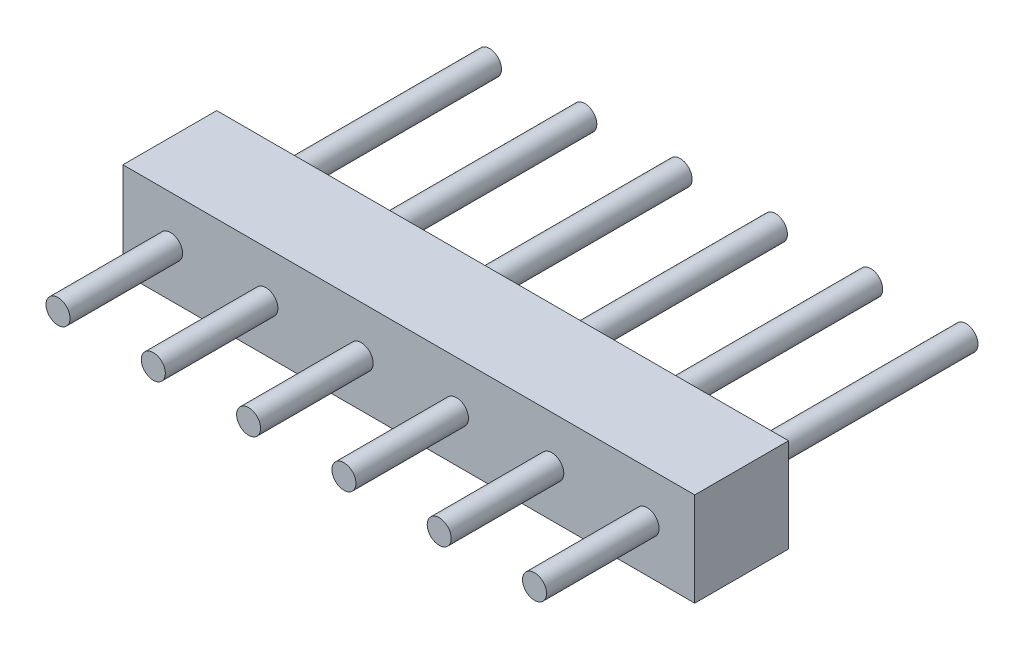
from build123d import *

# Parameters (mm, degrees)
SKETCH1_W           = 15.24
SKETCH1_H           = 2.5
BOSS_EXTRUDE1_DEPTH = 2.5
SKETCH2_R           = 0.32
BOSS_EXTRUDE2_DEPTH = 3
BOSS_EXTRUDE3_START = -8.5
SKETCH2_2_R         = 0.32
BOSS_EXTRUDE3_DEPTH = 6


with BuildPart() as part:
    # Sketch1 → Boss-Extrude1 (new body)
    with BuildSketch(Plane.XY):
        with Locations((7.62, 1.25)):
            Rectangle(SKETCH1_W, SKETCH1_H)
    extrude(amount=BOSS_EXTRUDE1_DEPTH)

    # Sketch2 → Boss-Extrude2 (add)
    with BuildSketch(Plane.XY.offset(2.5)):
        with Locations(Location((1.27, 1.25, 0), (0, 0, 180))):
            Circle(SKETCH2_R)
        with Locations(Location((3.81, 1.25, 0), (0, 0, 180))):
            Circle(SKETCH2_R)
        with Locations(Location((6.35, 1.25, 0), (0, 0, 180))):
            Circle(SKETCH2_R)
        with Locations(Location((8.89, 1.25, 0), (0, 0, 180))):
            Circle(SKETCH2_R)
        with Locations(Location((11.43, 1.25, 0), (0, 0, 180))):
            Circle(SKETCH2_R)
        with Locations(Location((13.97, 1.25, 0), (0, 0, 180))):
            Circle(SKETCH2_R)
    extrude(amount=BOSS_EXTRUDE2_DEPTH)

    # Sketch2_2 → Boss-Extrude3 (add)
    with BuildSketch(Plane.XY.offset(2.5).offset(BOSS_EXTRUDE3_START)):
        with Locations(Location((1.27, 1.25, 0), (0, 0, 180))):
            Circle(SKETCH2_2_R)
        with Locations(Location((3.81, 1.25, 0), (0, 0, 180))):
            Circle(SKETCH2_2_R)
        with Locations(Location((6.35, 1.25, 0), (0, 0, 180))):
            Circle(SKETCH2_2_R)
        with Locations(Location((8.89, 1.25, 0), (0, 0, 180))):
            Circle(SKETCH2_2_R)
        with Locations(Location((11.43, 1.25, 0), (0, 0, 180))):
            Circle(SKETCH2_2_R)
        with Locations(Location((13.97, 1.25, 0), (0, 0, 180))):
            Circle(SKETCH2_2_R)
    extrude(amount=BOSS_EXTRUDE3_DEPTH)


solid = part.part
